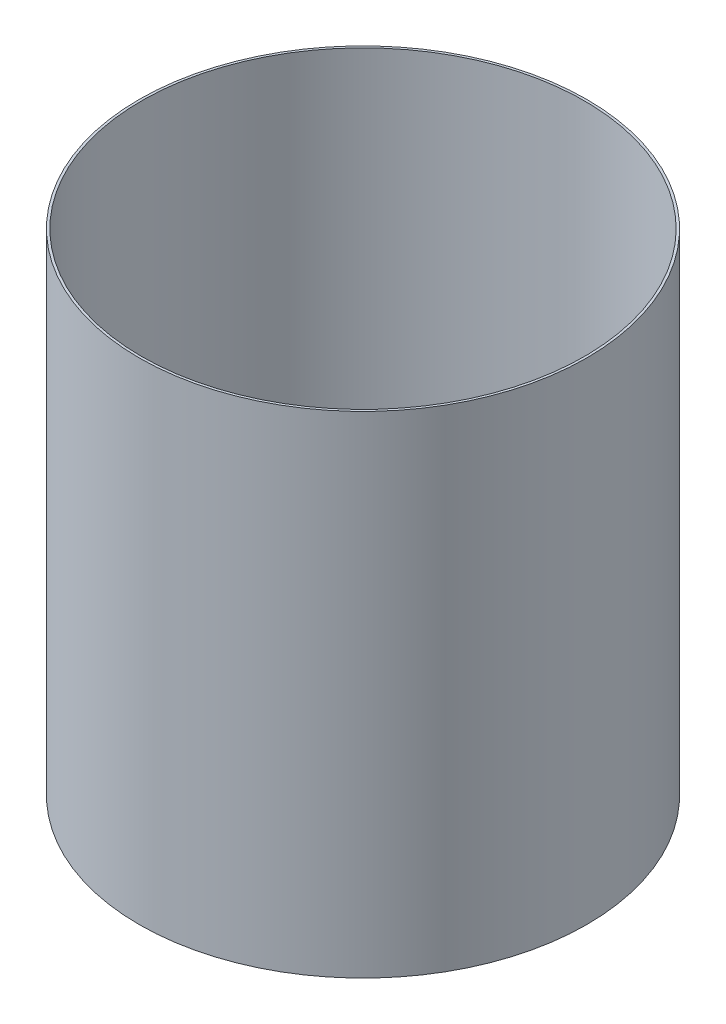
from build123d import *

# Parameters (mm, degrees)
ESQUISSE1_W = 1
ESQUISSE1_H = 205


with BuildPart() as part:
    # Esquisse1 → R_vol.-Mince2 (revolve)
    with BuildSketch(Plane.XY, mode=Mode.PRIVATE) as r_vol_mince2_sk:
        with Locations((-93, -32.969895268)):
            Rectangle(ESQUISSE1_W, ESQUISSE1_H)
    revolve(r_vol_mince2_sk.sketch.rotate(Axis((0, 87.648755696, 0), (0, -1, 0)), 270), axis=Axis((0, 87.648755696, 0), (0, -1, 0)))


solid = part.part
